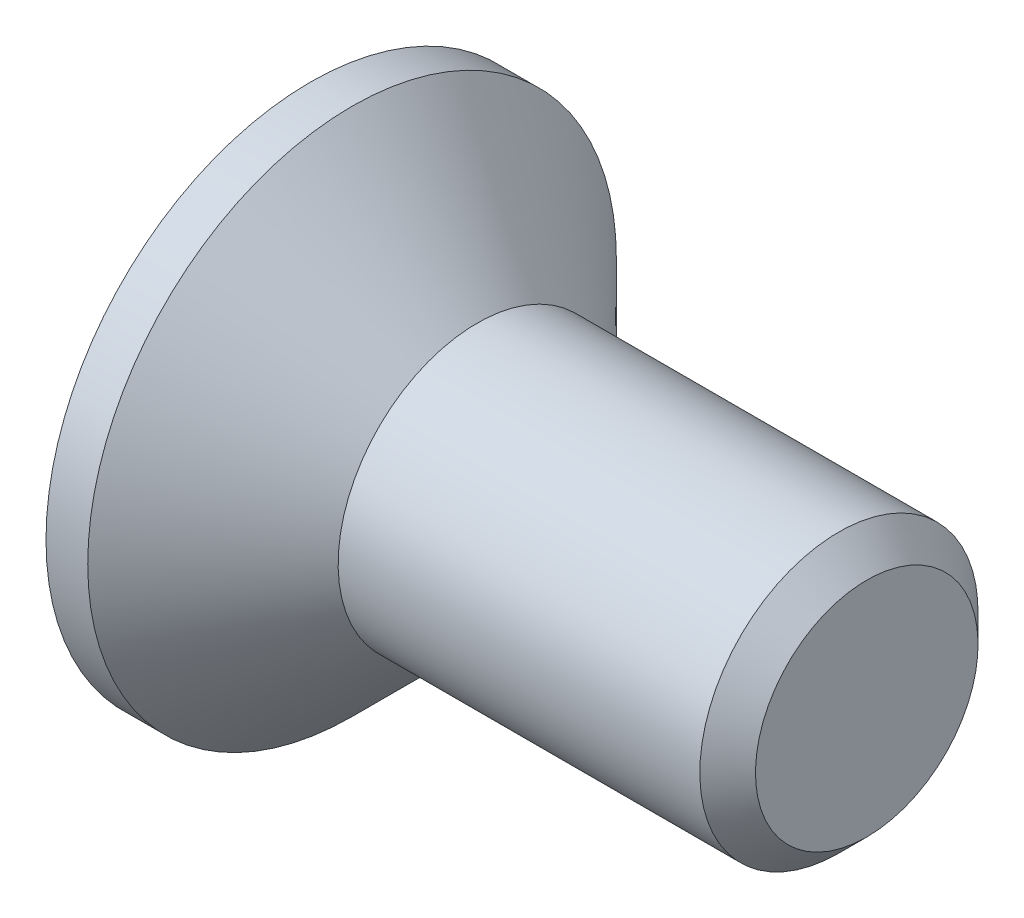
ISO-10303-21;
HEADER;
FILE_DESCRIPTION(('STEP AP214'),'2;1');
FILE_NAME('part.step','',(''),(''),'','','');
FILE_SCHEMA(('AUTOMOTIVE_DESIGN { 1 0 10303 214 1 1 1 1 }'));
ENDSEC;
DATA;
#1=APPLICATION_CONTEXT('core data for automotive mechanical design processes');
#2=APPLICATION_PROTOCOL_DEFINITION('international standard','automotive_design',2000,#1);
#3=PRODUCT_CONTEXT('',#1,'mechanical');
#4=PRODUCT('Part','Part','',(#3));
#5=PRODUCT_RELATED_PRODUCT_CATEGORY('part','',(#4));
#6=PRODUCT_DEFINITION_FORMATION('','',#4);
#7=PRODUCT_DEFINITION_CONTEXT('part definition',#1,'design');
#8=PRODUCT_DEFINITION('design','',#6,#7);
#9=PRODUCT_DEFINITION_SHAPE('','',#8);
#10=(LENGTH_UNIT() NAMED_UNIT(*) SI_UNIT(.MILLI.,.METRE.));
#11=(NAMED_UNIT(*) PLANE_ANGLE_UNIT() SI_UNIT($,.RADIAN.));
#12=(NAMED_UNIT(*) SI_UNIT($,.STERADIAN.) SOLID_ANGLE_UNIT());
#13=UNCERTAINTY_MEASURE_WITH_UNIT(LENGTH_MEASURE(1.E-05),#10,'distance_accuracy_value','');
#14=(GEOMETRIC_REPRESENTATION_CONTEXT(3) GLOBAL_UNCERTAINTY_ASSIGNED_CONTEXT((#13)) GLOBAL_UNIT_ASSIGNED_CONTEXT((#10,
#11,#12)) REPRESENTATION_CONTEXT('',''));
#15=CARTESIAN_POINT('',(0.,0.,0.));
#16=DIRECTION('',(0.,0.,1.));
#17=DIRECTION('',(1.,0.,0.));
#18=AXIS2_PLACEMENT_3D('',#15,#16,#17);
#19=CARTESIAN_POINT('',(0.,0.,0.));
#20=DIRECTION('',(-1.,0.,0.));
#21=DIRECTION('',(0.,-1.,0.));
#22=AXIS2_PLACEMENT_3D('',#19,#20,#21);
#23=CONICAL_SURFACE('',#22,1.,0.78539816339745);
#24=CARTESIAN_POINT('',(-0.899999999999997,0.,0.));
#25=DIRECTION('',(-1.,0.,0.));
#26=DIRECTION('',(0.,-1.,0.));
#27=AXIS2_PLACEMENT_3D('',#24,#25,#26);
#28=CIRCLE('',#27,1.9);
#29=CARTESIAN_POINT('',(-0.899999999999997,-1.9,0.));
#30=VERTEX_POINT('',#29);
#31=EDGE_CURVE('E189',#30,#30,#28,.T.);
#32=ORIENTED_EDGE('',*,*,#31,.F.);
#33=EDGE_LOOP('',(#32));
#34=FACE_BOUND('',#33,.T.);
#35=CARTESIAN_POINT('',(0.,0.,0.));
#36=DIRECTION('',(-1.,0.,0.));
#37=DIRECTION('',(0.,-1.,0.));
#38=AXIS2_PLACEMENT_3D('',#35,#36,#37);
#39=CIRCLE('',#38,1.);
#40=CARTESIAN_POINT('',(0.,-1.,0.));
#41=VERTEX_POINT('',#40);
#42=EDGE_CURVE('E212',#41,#41,#39,.T.);
#43=ORIENTED_EDGE('',*,*,#42,.T.);
#44=EDGE_LOOP('',(#43));
#45=FACE_BOUND('',#44,.T.);
#46=ADVANCED_FACE('F33',(#34,#45),#23,.T.);
#47=CARTESIAN_POINT('',(-1.2,0.,0.));
#48=DIRECTION('',(-1.,0.,0.));
#49=DIRECTION('',(0.,-1.,0.));
#50=AXIS2_PLACEMENT_3D('',#47,#48,#49);
#51=CYLINDRICAL_SURFACE('',#50,1.);
#52=CARTESIAN_POINT('',(2.6,0.,0.));
#53=DIRECTION('',(-1.,0.,0.));
#54=DIRECTION('',(0.,-1.,0.));
#55=AXIS2_PLACEMENT_3D('',#52,#53,#54);
#56=CIRCLE('',#55,1.);
#57=CARTESIAN_POINT('',(2.6,-1.,0.));
#58=VERTEX_POINT('',#57);
#59=EDGE_CURVE('E41',#58,#58,#56,.T.);
#60=ORIENTED_EDGE('',*,*,#59,.T.);
#61=EDGE_LOOP('',(#60));
#62=FACE_BOUND('',#61,.T.);
#63=ORIENTED_EDGE('',*,*,#42,.F.);
#64=EDGE_LOOP('',(#63));
#65=FACE_BOUND('',#64,.T.);
#66=ADVANCED_FACE('F217',(#62,#65),#51,.T.);
#67=CARTESIAN_POINT('',(2.8,0.,0.));
#68=DIRECTION('',(-1.,0.,0.));
#69=DIRECTION('',(0.,-1.,0.));
#70=AXIS2_PLACEMENT_3D('',#67,#68,#69);
#71=PLANE('',#70);
#72=CARTESIAN_POINT('',(2.8,0.,0.));
#73=DIRECTION('',(-1.,0.,0.));
#74=DIRECTION('',(0.,-1.,0.));
#75=AXIS2_PLACEMENT_3D('',#72,#73,#74);
#76=CIRCLE('',#75,0.799999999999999);
#77=CARTESIAN_POINT('',(2.8,-0.799999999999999,0.));
#78=VERTEX_POINT('',#77);
#79=EDGE_CURVE('E11',#78,#78,#76,.F.);
#80=ORIENTED_EDGE('',*,*,#79,.T.);
#81=EDGE_LOOP('',(#80));
#82=FACE_BOUND('',#81,.T.);
#83=ADVANCED_FACE('F239',(#82),#71,.F.);
#84=CARTESIAN_POINT('',(-1.2,1.9,0.));
#85=DIRECTION('',(1.,0.,0.));
#86=DIRECTION('',(0.,1.,0.));
#87=AXIS2_PLACEMENT_3D('',#84,#85,#86);
#88=PLANE('',#87);
#89=DIRECTION('',(0.,0.,-1.));
#90=VECTOR('',#89,1.);
#91=CARTESIAN_POINT('',(-1.2,0.3,-1.175));
#92=LINE('',#91,#90);
#93=CARTESIAN_POINT('',(-1.2,0.3,-0.3));
#94=VERTEX_POINT('',#93);
#95=CARTESIAN_POINT('',(-1.2,0.3,-1.175));
#96=VERTEX_POINT('',#95);
#97=EDGE_CURVE('E158',#94,#96,#92,.T.);
#98=ORIENTED_EDGE('',*,*,#97,.F.);
#99=DIRECTION('',(0.,-1.,0.));
#100=VECTOR('',#99,1.);
#101=CARTESIAN_POINT('',(-1.2,0.3,-0.3));
#102=LINE('',#101,#100);
#103=CARTESIAN_POINT('',(-1.2,1.175,-0.3));
#104=VERTEX_POINT('',#103);
#105=EDGE_CURVE('E48',#104,#94,#102,.T.);
#106=ORIENTED_EDGE('',*,*,#105,.F.);
#107=DIRECTION('',(0.,0.,-1.));
#108=VECTOR('',#107,1.);
#109=CARTESIAN_POINT('',(-1.2,1.175,-0.3));
#110=LINE('',#109,#108);
#111=CARTESIAN_POINT('',(-1.2,1.175,0.3));
#112=VERTEX_POINT('',#111);
#113=EDGE_CURVE('E185',#112,#104,#110,.T.);
#114=ORIENTED_EDGE('',*,*,#113,.F.);
#115=DIRECTION('',(0.,1.,0.));
#116=VECTOR('',#115,1.);
#117=CARTESIAN_POINT('',(-1.2,1.175,0.3));
#118=LINE('',#117,#116);
#119=CARTESIAN_POINT('',(-1.2,0.3,0.3));
#120=VERTEX_POINT('',#119);
#121=EDGE_CURVE('E183',#120,#112,#118,.T.);
#122=ORIENTED_EDGE('',*,*,#121,.F.);
#123=DIRECTION('',(0.,0.,-1.));
#124=VECTOR('',#123,1.);
#125=CARTESIAN_POINT('',(-1.2,0.3,0.3));
#126=LINE('',#125,#124);
#127=CARTESIAN_POINT('',(-1.2,0.3,1.175));
#128=VERTEX_POINT('',#127);
#129=EDGE_CURVE('E132',#128,#120,#126,.T.);
#130=ORIENTED_EDGE('',*,*,#129,.F.);
#131=DIRECTION('',(0.,1.,0.));
#132=VECTOR('',#131,1.);
#133=CARTESIAN_POINT('',(-1.2,0.3,1.175));
#134=LINE('',#133,#132);
#135=CARTESIAN_POINT('',(-1.2,-0.3,1.175));
#136=VERTEX_POINT('',#135);
#137=EDGE_CURVE('E179',#136,#128,#134,.T.);
#138=ORIENTED_EDGE('',*,*,#137,.F.);
#139=DIRECTION('',(0.,0.,1.));
#140=VECTOR('',#139,1.);
#141=CARTESIAN_POINT('',(-1.2,-0.3,1.175));
#142=LINE('',#141,#140);
#143=CARTESIAN_POINT('',(-1.2,-0.3,0.3));
#144=VERTEX_POINT('',#143);
#145=EDGE_CURVE('E176',#144,#136,#142,.T.);
#146=ORIENTED_EDGE('',*,*,#145,.F.);
#147=DIRECTION('',(0.,1.,0.));
#148=VECTOR('',#147,1.);
#149=CARTESIAN_POINT('',(-1.2,-0.3,0.3));
#150=LINE('',#149,#148);
#151=CARTESIAN_POINT('',(-1.2,-1.175,0.3));
#152=VERTEX_POINT('',#151);
#153=EDGE_CURVE('E173',#152,#144,#150,.T.);
#154=ORIENTED_EDGE('',*,*,#153,.F.);
#155=DIRECTION('',(0.,0.,1.));
#156=VECTOR('',#155,1.);
#157=CARTESIAN_POINT('',(-1.2,-1.175,0.3));
#158=LINE('',#157,#156);
#159=CARTESIAN_POINT('',(-1.2,-1.175,-0.3));
#160=VERTEX_POINT('',#159);
#161=EDGE_CURVE('E170',#160,#152,#158,.T.);
#162=ORIENTED_EDGE('',*,*,#161,.F.);
#163=DIRECTION('',(0.,-1.,0.));
#164=VECTOR('',#163,1.);
#165=CARTESIAN_POINT('',(-1.2,-1.175,-0.3));
#166=LINE('',#165,#164);
#167=CARTESIAN_POINT('',(-1.2,-0.3,-0.3));
#168=VERTEX_POINT('',#167);
#169=EDGE_CURVE('E167',#168,#160,#166,.T.);
#170=ORIENTED_EDGE('',*,*,#169,.F.);
#171=DIRECTION('',(0.,0.,1.));
#172=VECTOR('',#171,1.);
#173=CARTESIAN_POINT('',(-1.2,-0.3,-0.3));
#174=LINE('',#173,#172);
#175=CARTESIAN_POINT('',(-1.2,-0.3,-1.175));
#176=VERTEX_POINT('',#175);
#177=EDGE_CURVE('E164',#176,#168,#174,.T.);
#178=ORIENTED_EDGE('',*,*,#177,.F.);
#179=DIRECTION('',(0.,-1.,0.));
#180=VECTOR('',#179,1.);
#181=CARTESIAN_POINT('',(-1.2,-0.3,-1.175));
#182=LINE('',#181,#180);
#183=EDGE_CURVE('E161',#96,#176,#182,.T.);
#184=ORIENTED_EDGE('',*,*,#183,.F.);
#185=EDGE_LOOP('',(#98,#106,#114,#122,#130,#138,#146,#154,#162,#170,#178,#184));
#186=FACE_BOUND('',#185,.T.);
#187=CARTESIAN_POINT('',(-1.2,0.,0.));
#188=DIRECTION('',(-1.,0.,0.));
#189=DIRECTION('',(0.,-1.,0.));
#190=AXIS2_PLACEMENT_3D('',#187,#188,#189);
#191=CIRCLE('',#190,1.9);
#192=CARTESIAN_POINT('',(-1.2,-1.9,0.));
#193=VERTEX_POINT('',#192);
#194=EDGE_CURVE('E209',#193,#193,#191,.T.);
#195=ORIENTED_EDGE('',*,*,#194,.T.);
#196=EDGE_LOOP('',(#195));
#197=FACE_BOUND('',#196,.T.);
#198=ADVANCED_FACE('F230',(#186,#197),#88,.F.);
#199=CARTESIAN_POINT('',(-1.2,0.,0.));
#200=DIRECTION('',(-1.,0.,0.));
#201=DIRECTION('',(0.,-1.,0.));
#202=AXIS2_PLACEMENT_3D('',#199,#200,#201);
#203=CYLINDRICAL_SURFACE('',#202,1.9);
#204=ORIENTED_EDGE('',*,*,#194,.F.);
#205=EDGE_LOOP('',(#204));
#206=FACE_BOUND('',#205,.T.);
#207=ORIENTED_EDGE('',*,*,#31,.T.);
#208=EDGE_LOOP('',(#207));
#209=FACE_BOUND('',#208,.T.);
#210=ADVANCED_FACE('F222',(#206,#209),#203,.T.);
#211=CARTESIAN_POINT('',(2.6,0.,0.));
#212=DIRECTION('',(-1.,0.,0.));
#213=DIRECTION('',(0.,-1.,0.));
#214=AXIS2_PLACEMENT_3D('',#211,#212,#213);
#215=CONICAL_SURFACE('',#214,1.,0.785398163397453);
#216=ORIENTED_EDGE('',*,*,#79,.F.);
#217=EDGE_LOOP('',(#216));
#218=FACE_BOUND('',#217,.T.);
#219=ORIENTED_EDGE('',*,*,#59,.F.);
#220=EDGE_LOOP('',(#219));
#221=FACE_BOUND('',#220,.T.);
#222=ADVANCED_FACE('F35',(#218,#221),#215,.T.);
#223=CARTESIAN_POINT('',(-0.249999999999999,0.3,-0.3));
#224=DIRECTION('',(0.,0.,-1.));
#225=DIRECTION('',(0.,1.,0.));
#226=AXIS2_PLACEMENT_3D('',#223,#224,#225);
#227=PLANE('',#226);
#228=ORIENTED_EDGE('',*,*,#105,.T.);
#229=DIRECTION('',(-1.,0.,0.));
#230=VECTOR('',#229,1.);
#231=CARTESIAN_POINT('',(-0.249999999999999,0.3,-0.3));
#232=LINE('',#231,#230);
#233=CARTESIAN_POINT('',(-0.249999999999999,0.3,-0.3));
#234=VERTEX_POINT('',#233);
#235=EDGE_CURVE('E96',#234,#94,#232,.T.);
#236=ORIENTED_EDGE('',*,*,#235,.F.);
#237=DIRECTION('',(0.,-1.,0.));
#238=VECTOR('',#237,1.);
#239=CARTESIAN_POINT('',(-0.249999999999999,0.3,-0.3));
#240=LINE('',#239,#238);
#241=CARTESIAN_POINT('',(-0.249999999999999,1.175,-0.3));
#242=VERTEX_POINT('',#241);
#243=EDGE_CURVE('E187',#242,#234,#240,.T.);
#244=ORIENTED_EDGE('',*,*,#243,.F.);
#245=DIRECTION('',(-1.,0.,0.));
#246=VECTOR('',#245,1.);
#247=CARTESIAN_POINT('',(-0.249999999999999,1.175,-0.3));
#248=LINE('',#247,#246);
#249=EDGE_CURVE('E56',#242,#104,#248,.T.);
#250=ORIENTED_EDGE('',*,*,#249,.T.);
#251=EDGE_LOOP('',(#228,#236,#244,#250));
#252=FACE_BOUND('',#251,.T.);
#253=ADVANCED_FACE('F221',(#252),#227,.F.);
#254=CARTESIAN_POINT('',(-0.249999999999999,1.175,-0.3));
#255=DIRECTION('',(0.,1.,0.));
#256=DIRECTION('',(-1.,0.,0.));
#257=AXIS2_PLACEMENT_3D('',#254,#255,#256);
#258=PLANE('',#257);
#259=ORIENTED_EDGE('',*,*,#113,.T.);
#260=ORIENTED_EDGE('',*,*,#249,.F.);
#261=DIRECTION('',(0.,0.,-1.));
#262=VECTOR('',#261,1.);
#263=CARTESIAN_POINT('',(-0.249999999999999,1.175,-0.3));
#264=LINE('',#263,#262);
#265=CARTESIAN_POINT('',(-0.249999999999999,1.175,0.3));
#266=VERTEX_POINT('',#265);
#267=EDGE_CURVE('E144',#266,#242,#264,.T.);
#268=ORIENTED_EDGE('',*,*,#267,.F.);
#269=DIRECTION('',(-1.,0.,0.));
#270=VECTOR('',#269,1.);
#271=CARTESIAN_POINT('',(-0.249999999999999,1.175,0.3));
#272=LINE('',#271,#270);
#273=EDGE_CURVE('E136',#266,#112,#272,.T.);
#274=ORIENTED_EDGE('',*,*,#273,.T.);
#275=EDGE_LOOP('',(#259,#260,#268,#274));
#276=FACE_BOUND('',#275,.T.);
#277=ADVANCED_FACE('F228',(#276),#258,.F.);
#278=CARTESIAN_POINT('',(-0.249999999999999,1.175,0.3));
#279=DIRECTION('',(0.,0.,1.));
#280=DIRECTION('',(0.,-1.,0.));
#281=AXIS2_PLACEMENT_3D('',#278,#279,#280);
#282=PLANE('',#281);
#283=ORIENTED_EDGE('',*,*,#121,.T.);
#284=ORIENTED_EDGE('',*,*,#273,.F.);
#285=DIRECTION('',(0.,1.,0.));
#286=VECTOR('',#285,1.);
#287=CARTESIAN_POINT('',(-0.249999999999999,1.175,0.3));
#288=LINE('',#287,#286);
#289=CARTESIAN_POINT('',(-0.249999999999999,0.3,0.3));
#290=VERTEX_POINT('',#289);
#291=EDGE_CURVE('E140',#290,#266,#288,.T.);
#292=ORIENTED_EDGE('',*,*,#291,.F.);
#293=DIRECTION('',(-1.,0.,0.));
#294=VECTOR('',#293,1.);
#295=CARTESIAN_POINT('',(-0.249999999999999,0.3,0.3));
#296=LINE('',#295,#294);
#297=EDGE_CURVE('E125',#290,#120,#296,.T.);
#298=ORIENTED_EDGE('',*,*,#297,.T.);
#299=EDGE_LOOP('',(#283,#284,#292,#298));
#300=FACE_BOUND('',#299,.T.);
#301=ADVANCED_FACE('F141',(#300),#282,.F.);
#302=CARTESIAN_POINT('',(-0.249999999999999,0.3,0.3));
#303=DIRECTION('',(0.,1.,0.));
#304=DIRECTION('',(0.,0.,1.));
#305=AXIS2_PLACEMENT_3D('',#302,#303,#304);
#306=PLANE('',#305);
#307=ORIENTED_EDGE('',*,*,#129,.T.);
#308=ORIENTED_EDGE('',*,*,#297,.F.);
#309=DIRECTION('',(0.,0.,-1.));
#310=VECTOR('',#309,1.);
#311=CARTESIAN_POINT('',(-0.249999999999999,0.3,0.3));
#312=LINE('',#311,#310);
#313=CARTESIAN_POINT('',(-0.249999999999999,0.3,1.175));
#314=VERTEX_POINT('',#313);
#315=EDGE_CURVE('E129',#314,#290,#312,.T.);
#316=ORIENTED_EDGE('',*,*,#315,.F.);
#317=DIRECTION('',(-1.,0.,0.));
#318=VECTOR('',#317,1.);
#319=CARTESIAN_POINT('',(-0.249999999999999,0.3,1.175));
#320=LINE('',#319,#318);
#321=EDGE_CURVE('E137',#314,#128,#320,.T.);
#322=ORIENTED_EDGE('',*,*,#321,.T.);
#323=EDGE_LOOP('',(#307,#308,#316,#322));
#324=FACE_BOUND('',#323,.T.);
#325=ADVANCED_FACE('F127',(#324),#306,.F.);
#326=CARTESIAN_POINT('',(-0.249999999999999,0.3,1.175));
#327=DIRECTION('',(0.,0.,1.));
#328=DIRECTION('',(1.,0.,0.));
#329=AXIS2_PLACEMENT_3D('',#326,#327,#328);
#330=PLANE('',#329);
#331=ORIENTED_EDGE('',*,*,#137,.T.);
#332=ORIENTED_EDGE('',*,*,#321,.F.);
#333=DIRECTION('',(0.,1.,0.));
#334=VECTOR('',#333,1.);
#335=CARTESIAN_POINT('',(-0.249999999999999,0.3,1.175));
#336=LINE('',#335,#334);
#337=CARTESIAN_POINT('',(-0.249999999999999,-0.3,1.175));
#338=VERTEX_POINT('',#337);
#339=EDGE_CURVE('E150',#338,#314,#336,.T.);
#340=ORIENTED_EDGE('',*,*,#339,.F.);
#341=DIRECTION('',(-1.,0.,0.));
#342=VECTOR('',#341,1.);
#343=CARTESIAN_POINT('',(-0.249999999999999,-0.3,1.175));
#344=LINE('',#343,#342);
#345=EDGE_CURVE('E192',#338,#136,#344,.T.);
#346=ORIENTED_EDGE('',*,*,#345,.T.);
#347=EDGE_LOOP('',(#331,#332,#340,#346));
#348=FACE_BOUND('',#347,.T.);
#349=ADVANCED_FACE('F277',(#348),#330,.F.);
#350=CARTESIAN_POINT('',(-0.249999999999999,-0.3,1.175));
#351=DIRECTION('',(0.,-1.,0.));
#352=DIRECTION('',(0.,0.,-1.));
#353=AXIS2_PLACEMENT_3D('',#350,#351,#352);
#354=PLANE('',#353);
#355=ORIENTED_EDGE('',*,*,#145,.T.);
#356=ORIENTED_EDGE('',*,*,#345,.F.);
#357=DIRECTION('',(0.,0.,1.));
#358=VECTOR('',#357,1.);
#359=CARTESIAN_POINT('',(-0.249999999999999,-0.3,1.175));
#360=LINE('',#359,#358);
#361=CARTESIAN_POINT('',(-0.249999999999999,-0.3,0.3));
#362=VERTEX_POINT('',#361);
#363=EDGE_CURVE('E152',#362,#338,#360,.T.);
#364=ORIENTED_EDGE('',*,*,#363,.F.);
#365=DIRECTION('',(-1.,0.,0.));
#366=VECTOR('',#365,1.);
#367=CARTESIAN_POINT('',(-0.249999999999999,-0.3,0.3));
#368=LINE('',#367,#366);
#369=EDGE_CURVE('E194',#362,#144,#368,.T.);
#370=ORIENTED_EDGE('',*,*,#369,.T.);
#371=EDGE_LOOP('',(#355,#356,#364,#370));
#372=FACE_BOUND('',#371,.T.);
#373=ADVANCED_FACE('F273',(#372),#354,.F.);
#374=CARTESIAN_POINT('',(-0.249999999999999,-0.3,0.3));
#375=DIRECTION('',(0.,0.,1.));
#376=DIRECTION('',(1.,0.,0.));
#377=AXIS2_PLACEMENT_3D('',#374,#375,#376);
#378=PLANE('',#377);
#379=ORIENTED_EDGE('',*,*,#153,.T.);
#380=ORIENTED_EDGE('',*,*,#369,.F.);
#381=DIRECTION('',(0.,1.,0.));
#382=VECTOR('',#381,1.);
#383=CARTESIAN_POINT('',(-0.249999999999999,-0.3,0.3));
#384=LINE('',#383,#382);
#385=CARTESIAN_POINT('',(-0.249999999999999,-1.175,0.3));
#386=VERTEX_POINT('',#385);
#387=EDGE_CURVE('E422',#386,#362,#384,.T.);
#388=ORIENTED_EDGE('',*,*,#387,.F.);
#389=DIRECTION('',(-1.,0.,0.));
#390=VECTOR('',#389,1.);
#391=CARTESIAN_POINT('',(-0.249999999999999,-1.175,0.3));
#392=LINE('',#391,#390);
#393=EDGE_CURVE('E196',#386,#152,#392,.T.);
#394=ORIENTED_EDGE('',*,*,#393,.T.);
#395=EDGE_LOOP('',(#379,#380,#388,#394));
#396=FACE_BOUND('',#395,.T.);
#397=ADVANCED_FACE('F269',(#396),#378,.F.);
#398=CARTESIAN_POINT('',(-0.249999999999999,-1.175,0.3));
#399=DIRECTION('',(0.,-1.,0.));
#400=DIRECTION('',(1.,0.,0.));
#401=AXIS2_PLACEMENT_3D('',#398,#399,#400);
#402=PLANE('',#401);
#403=ORIENTED_EDGE('',*,*,#161,.T.);
#404=ORIENTED_EDGE('',*,*,#393,.F.);
#405=DIRECTION('',(0.,0.,1.));
#406=VECTOR('',#405,1.);
#407=CARTESIAN_POINT('',(-0.249999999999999,-1.175,0.3));
#408=LINE('',#407,#406);
#409=CARTESIAN_POINT('',(-0.249999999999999,-1.175,-0.3));
#410=VERTEX_POINT('',#409);
#411=EDGE_CURVE('E419',#410,#386,#408,.T.);
#412=ORIENTED_EDGE('',*,*,#411,.F.);
#413=DIRECTION('',(-1.,0.,0.));
#414=VECTOR('',#413,1.);
#415=CARTESIAN_POINT('',(-0.249999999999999,-1.175,-0.3));
#416=LINE('',#415,#414);
#417=EDGE_CURVE('E198',#410,#160,#416,.T.);
#418=ORIENTED_EDGE('',*,*,#417,.T.);
#419=EDGE_LOOP('',(#403,#404,#412,#418));
#420=FACE_BOUND('',#419,.T.);
#421=ADVANCED_FACE('F265',(#420),#402,.F.);
#422=CARTESIAN_POINT('',(-0.249999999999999,-1.175,-0.3));
#423=DIRECTION('',(0.,0.,-1.));
#424=DIRECTION('',(0.,1.,0.));
#425=AXIS2_PLACEMENT_3D('',#422,#423,#424);
#426=PLANE('',#425);
#427=ORIENTED_EDGE('',*,*,#169,.T.);
#428=ORIENTED_EDGE('',*,*,#417,.F.);
#429=DIRECTION('',(0.,-1.,0.));
#430=VECTOR('',#429,1.);
#431=CARTESIAN_POINT('',(-0.249999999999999,-1.175,-0.3));
#432=LINE('',#431,#430);
#433=CARTESIAN_POINT('',(-0.249999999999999,-0.3,-0.3));
#434=VERTEX_POINT('',#433);
#435=EDGE_CURVE('E416',#434,#410,#432,.T.);
#436=ORIENTED_EDGE('',*,*,#435,.F.);
#437=DIRECTION('',(-1.,0.,0.));
#438=VECTOR('',#437,1.);
#439=CARTESIAN_POINT('',(-0.249999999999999,-0.3,-0.3));
#440=LINE('',#439,#438);
#441=EDGE_CURVE('E200',#434,#168,#440,.T.);
#442=ORIENTED_EDGE('',*,*,#441,.T.);
#443=EDGE_LOOP('',(#427,#428,#436,#442));
#444=FACE_BOUND('',#443,.T.);
#445=ADVANCED_FACE('F261',(#444),#426,.F.);
#446=CARTESIAN_POINT('',(-0.249999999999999,-0.3,-0.3));
#447=DIRECTION('',(0.,-1.,0.));
#448=DIRECTION('',(0.,0.,-1.));
#449=AXIS2_PLACEMENT_3D('',#446,#447,#448);
#450=PLANE('',#449);
#451=ORIENTED_EDGE('',*,*,#177,.T.);
#452=ORIENTED_EDGE('',*,*,#441,.F.);
#453=DIRECTION('',(0.,0.,1.));
#454=VECTOR('',#453,1.);
#455=CARTESIAN_POINT('',(-0.249999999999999,-0.3,-0.3));
#456=LINE('',#455,#454);
#457=CARTESIAN_POINT('',(-0.249999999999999,-0.3,-1.175));
#458=VERTEX_POINT('',#457);
#459=EDGE_CURVE('E413',#458,#434,#456,.T.);
#460=ORIENTED_EDGE('',*,*,#459,.F.);
#461=DIRECTION('',(-1.,0.,0.));
#462=VECTOR('',#461,1.);
#463=CARTESIAN_POINT('',(-0.249999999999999,-0.3,-1.175));
#464=LINE('',#463,#462);
#465=EDGE_CURVE('E202',#458,#176,#464,.T.);
#466=ORIENTED_EDGE('',*,*,#465,.T.);
#467=EDGE_LOOP('',(#451,#452,#460,#466));
#468=FACE_BOUND('',#467,.T.);
#469=ADVANCED_FACE('F257',(#468),#450,.F.);
#470=CARTESIAN_POINT('',(-0.249999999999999,-0.3,-1.175));
#471=DIRECTION('',(0.,0.,-1.));
#472=DIRECTION('',(-1.,0.,0.));
#473=AXIS2_PLACEMENT_3D('',#470,#471,#472);
#474=PLANE('',#473);
#475=ORIENTED_EDGE('',*,*,#183,.T.);
#476=ORIENTED_EDGE('',*,*,#465,.F.);
#477=DIRECTION('',(0.,-1.,0.));
#478=VECTOR('',#477,1.);
#479=CARTESIAN_POINT('',(-0.249999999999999,-0.3,-1.175));
#480=LINE('',#479,#478);
#481=CARTESIAN_POINT('',(-0.249999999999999,0.3,-1.175));
#482=VERTEX_POINT('',#481);
#483=EDGE_CURVE('E408',#482,#458,#480,.T.);
#484=ORIENTED_EDGE('',*,*,#483,.F.);
#485=DIRECTION('',(-1.,0.,0.));
#486=VECTOR('',#485,1.);
#487=CARTESIAN_POINT('',(-0.249999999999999,0.3,-1.175));
#488=LINE('',#487,#486);
#489=EDGE_CURVE('E204',#482,#96,#488,.T.);
#490=ORIENTED_EDGE('',*,*,#489,.T.);
#491=EDGE_LOOP('',(#475,#476,#484,#490));
#492=FACE_BOUND('',#491,.T.);
#493=ADVANCED_FACE('F253',(#492),#474,.F.);
#494=CARTESIAN_POINT('',(-0.249999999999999,0.3,-1.175));
#495=DIRECTION('',(0.,1.,0.));
#496=DIRECTION('',(0.,0.,1.));
#497=AXIS2_PLACEMENT_3D('',#494,#495,#496);
#498=PLANE('',#497);
#499=ORIENTED_EDGE('',*,*,#97,.T.);
#500=ORIENTED_EDGE('',*,*,#489,.F.);
#501=DIRECTION('',(0.,0.,-1.));
#502=VECTOR('',#501,1.);
#503=CARTESIAN_POINT('',(-0.249999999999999,0.3,-1.175));
#504=LINE('',#503,#502);
#505=EDGE_CURVE('E406',#234,#482,#504,.T.);
#506=ORIENTED_EDGE('',*,*,#505,.F.);
#507=ORIENTED_EDGE('',*,*,#235,.T.);
#508=EDGE_LOOP('',(#499,#500,#506,#507));
#509=FACE_BOUND('',#508,.T.);
#510=ADVANCED_FACE('F250',(#509),#498,.F.);
#511=CARTESIAN_POINT('',(-0.249999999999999,0.,0.));
#512=DIRECTION('',(1.,0.,0.));
#513=DIRECTION('',(0.,0.,-1.));
#514=AXIS2_PLACEMENT_3D('',#511,#512,#513);
#515=PLANE('',#514);
#516=ORIENTED_EDGE('',*,*,#243,.T.);
#517=ORIENTED_EDGE('',*,*,#505,.T.);
#518=ORIENTED_EDGE('',*,*,#483,.T.);
#519=ORIENTED_EDGE('',*,*,#459,.T.);
#520=ORIENTED_EDGE('',*,*,#435,.T.);
#521=ORIENTED_EDGE('',*,*,#411,.T.);
#522=ORIENTED_EDGE('',*,*,#387,.T.);
#523=ORIENTED_EDGE('',*,*,#363,.T.);
#524=ORIENTED_EDGE('',*,*,#339,.T.);
#525=ORIENTED_EDGE('',*,*,#315,.T.);
#526=ORIENTED_EDGE('',*,*,#291,.T.);
#527=ORIENTED_EDGE('',*,*,#267,.T.);
#528=EDGE_LOOP('',(#516,#517,#518,#519,#520,#521,#522,#523,#524,#525,#526,#527));
#529=FACE_BOUND('',#528,.T.);
#530=ADVANCED_FACE('F147',(#529),#515,.F.);
#531=CLOSED_SHELL('',(#46,#66,#83,#198,#210,#222,#253,#277,#301,#325,#349,#373,#397,#421,#445,
#469,#493,#510,#530));
#532=MANIFOLD_SOLID_BREP('B2',#531);
#533=ADVANCED_BREP_SHAPE_REPRESENTATION('',(#18,#532),#14);
#534=SHAPE_DEFINITION_REPRESENTATION(#9,#533);
ENDSEC;
END-ISO-10303-21;
